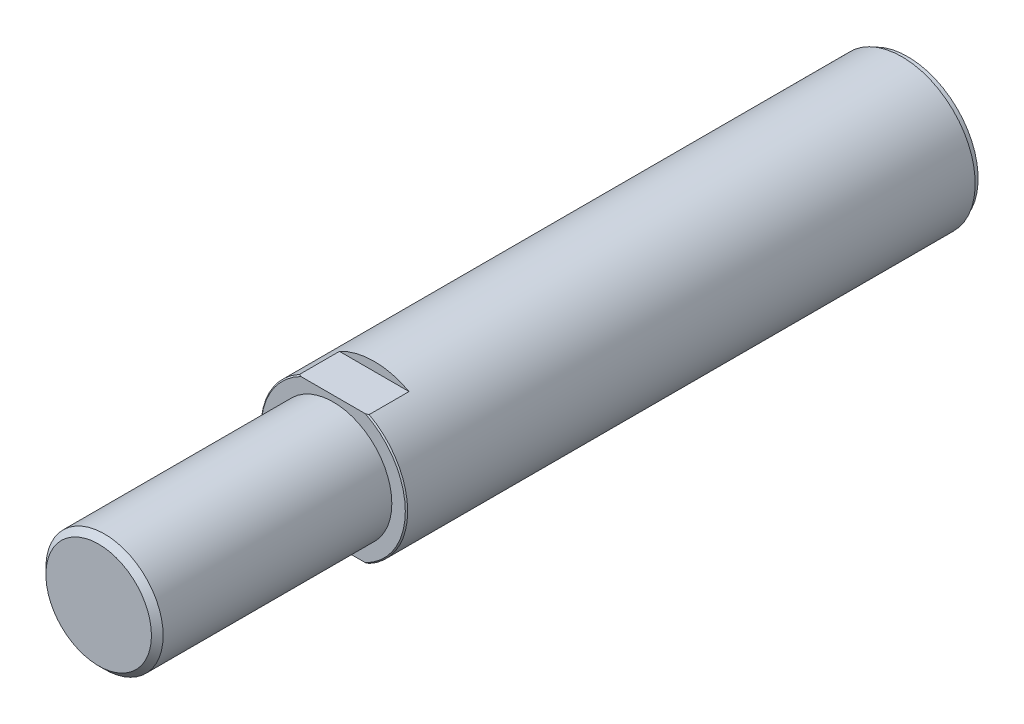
ISO-10303-21;
HEADER;
FILE_DESCRIPTION(('STEP AP214'),'2;1');
FILE_NAME('part.step','',(''),(''),'','','');
FILE_SCHEMA(('AUTOMOTIVE_DESIGN { 1 0 10303 214 1 1 1 1 }'));
ENDSEC;
DATA;
#1=APPLICATION_CONTEXT('core data for automotive mechanical design processes');
#2=APPLICATION_PROTOCOL_DEFINITION('international standard','automotive_design',2000,#1);
#3=PRODUCT_CONTEXT('',#1,'mechanical');
#4=PRODUCT('Part','Part','',(#3));
#5=PRODUCT_RELATED_PRODUCT_CATEGORY('part','',(#4));
#6=PRODUCT_DEFINITION_FORMATION('','',#4);
#7=PRODUCT_DEFINITION_CONTEXT('part definition',#1,'design');
#8=PRODUCT_DEFINITION('design','',#6,#7);
#9=PRODUCT_DEFINITION_SHAPE('','',#8);
#10=(LENGTH_UNIT() NAMED_UNIT(*) SI_UNIT(.MILLI.,.METRE.));
#11=(NAMED_UNIT(*) PLANE_ANGLE_UNIT() SI_UNIT($,.RADIAN.));
#12=(NAMED_UNIT(*) SI_UNIT($,.STERADIAN.) SOLID_ANGLE_UNIT());
#13=UNCERTAINTY_MEASURE_WITH_UNIT(LENGTH_MEASURE(1.E-05),#10,'distance_accuracy_value','');
#14=(GEOMETRIC_REPRESENTATION_CONTEXT(3) GLOBAL_UNCERTAINTY_ASSIGNED_CONTEXT((#13)) GLOBAL_UNIT_ASSIGNED_CONTEXT((#10,
#11,#12)) REPRESENTATION_CONTEXT('',''));
#15=CARTESIAN_POINT('',(0.,0.,0.));
#16=DIRECTION('',(0.,0.,1.));
#17=DIRECTION('',(1.,0.,0.));
#18=AXIS2_PLACEMENT_3D('',#15,#16,#17);
#19=CARTESIAN_POINT('',(0.,0.,138.));
#20=DIRECTION('',(0.,0.,-1.));
#21=DIRECTION('',(-1.,0.,0.));
#22=AXIS2_PLACEMENT_3D('',#19,#20,#21);
#23=CYLINDRICAL_SURFACE('',#22,12.5);
#24=CARTESIAN_POINT('',(0.,0.,1.));
#25=DIRECTION('',(0.,0.,-1.));
#26=DIRECTION('',(-1.,0.,0.));
#27=AXIS2_PLACEMENT_3D('',#24,#25,#26);
#28=CIRCLE('',#27,12.5);
#29=CARTESIAN_POINT('',(-12.5,0.,1.));
#30=VERTEX_POINT('',#29);
#31=EDGE_CURVE('E128',#30,#30,#28,.T.);
#32=ORIENTED_EDGE('',*,*,#31,.F.);
#33=EDGE_LOOP('',(#32));
#34=FACE_BOUND('',#33,.T.);
#35=DIRECTION('',(0.,0.,-1.));
#36=VECTOR('',#35,1.);
#37=CARTESIAN_POINT('',(-5.93717104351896,-11.,138.));
#38=LINE('',#37,#36);
#39=CARTESIAN_POINT('',(-5.93717104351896,-11.,97.8));
#40=VERTEX_POINT('',#39);
#41=CARTESIAN_POINT('',(-5.93717104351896,-11.,91.));
#42=VERTEX_POINT('',#41);
#43=EDGE_CURVE('E199',#40,#42,#38,.T.);
#44=ORIENTED_EDGE('',*,*,#43,.F.);
#45=CARTESIAN_POINT('',(0.,0.,97.8));
#46=DIRECTION('',(0.,0.,1.));
#47=DIRECTION('',(1.,0.,0.));
#48=AXIS2_PLACEMENT_3D('',#45,#46,#47);
#49=CIRCLE('',#48,12.5);
#50=CARTESIAN_POINT('',(-5.93717104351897,11.,97.8));
#51=VERTEX_POINT('',#50);
#52=EDGE_CURVE('E130',#40,#51,#49,.F.);
#53=ORIENTED_EDGE('',*,*,#52,.T.);
#54=DIRECTION('',(0.,0.,-1.));
#55=VECTOR('',#54,1.);
#56=CARTESIAN_POINT('',(-5.93717104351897,11.,138.));
#57=LINE('',#56,#55);
#58=CARTESIAN_POINT('',(-5.93717104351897,11.,91.));
#59=VERTEX_POINT('',#58);
#60=EDGE_CURVE('E57',#59,#51,#57,.F.);
#61=ORIENTED_EDGE('',*,*,#60,.F.);
#62=CARTESIAN_POINT('',(0.,0.,91.));
#63=DIRECTION('',(0.,0.,1.));
#64=DIRECTION('',(1.,0.,0.));
#65=AXIS2_PLACEMENT_3D('',#62,#63,#64);
#66=CIRCLE('',#65,12.5);
#67=CARTESIAN_POINT('',(5.93717104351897,11.,91.));
#68=VERTEX_POINT('',#67);
#69=EDGE_CURVE('E46',#68,#59,#66,.T.);
#70=ORIENTED_EDGE('',*,*,#69,.F.);
#71=DIRECTION('',(0.,0.,-1.));
#72=VECTOR('',#71,1.);
#73=CARTESIAN_POINT('',(5.93717104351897,11.,138.));
#74=LINE('',#73,#72);
#75=CARTESIAN_POINT('',(5.93717104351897,11.,97.8));
#76=VERTEX_POINT('',#75);
#77=EDGE_CURVE('E208',#76,#68,#74,.T.);
#78=ORIENTED_EDGE('',*,*,#77,.F.);
#79=CARTESIAN_POINT('',(5.93717104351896,-11.,97.8));
#80=VERTEX_POINT('',#79);
#81=EDGE_CURVE('E115',#76,#80,#49,.F.);
#82=ORIENTED_EDGE('',*,*,#81,.T.);
#83=DIRECTION('',(0.,0.,-1.));
#84=VECTOR('',#83,1.);
#85=CARTESIAN_POINT('',(5.93717104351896,-11.,138.));
#86=LINE('',#85,#84);
#87=CARTESIAN_POINT('',(5.93717104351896,-11.,91.));
#88=VERTEX_POINT('',#87);
#89=EDGE_CURVE('E65',#88,#80,#86,.F.);
#90=ORIENTED_EDGE('',*,*,#89,.F.);
#91=EDGE_CURVE('E12',#42,#88,#66,.T.);
#92=ORIENTED_EDGE('',*,*,#91,.F.);
#93=EDGE_LOOP('',(#44,#53,#61,#70,#78,#82,#90,#92));
#94=FACE_BOUND('',#93,.T.);
#95=ADVANCED_FACE('F42',(#34,#94),#23,.T.);
#96=CARTESIAN_POINT('',(0.,0.,98.));
#97=DIRECTION('',(0.,0.,1.));
#98=DIRECTION('',(1.,0.,0.));
#99=AXIS2_PLACEMENT_3D('',#96,#97,#98);
#100=PLANE('',#99);
#101=CARTESIAN_POINT('',(0.,0.,98.));
#102=DIRECTION('',(0.,0.,1.));
#103=DIRECTION('',(1.,0.,0.));
#104=AXIS2_PLACEMENT_3D('',#101,#102,#103);
#105=CIRCLE('',#104,10.);
#106=CARTESIAN_POINT('',(10.,0.,98.));
#107=VERTEX_POINT('',#106);
#108=EDGE_CURVE('E121',#107,#107,#105,.T.);
#109=ORIENTED_EDGE('',*,*,#108,.F.);
#110=EDGE_LOOP('',(#109));
#111=FACE_BOUND('',#110,.T.);
#112=CARTESIAN_POINT('',(0.,0.,98.));
#113=DIRECTION('',(0.,0.,1.));
#114=DIRECTION('',(1.,0.,0.));
#115=AXIS2_PLACEMENT_3D('',#112,#113,#114);
#116=CIRCLE('',#115,12.3);
#117=CARTESIAN_POINT('',(-5.50363516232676,11.,98.));
#118=VERTEX_POINT('',#117);
#119=CARTESIAN_POINT('',(-5.50363516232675,-11.,98.));
#120=VERTEX_POINT('',#119);
#121=EDGE_CURVE('E120',#118,#120,#116,.T.);
#122=ORIENTED_EDGE('',*,*,#121,.T.);
#123=DIRECTION('',(1.,0.,0.));
#124=VECTOR('',#123,1.);
#125=CARTESIAN_POINT('',(-21.0914396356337,-11.,98.));
#126=LINE('',#125,#124);
#127=CARTESIAN_POINT('',(5.50363516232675,-11.,98.));
#128=VERTEX_POINT('',#127);
#129=EDGE_CURVE('E107',#120,#128,#126,.T.);
#130=ORIENTED_EDGE('',*,*,#129,.T.);
#131=CARTESIAN_POINT('',(5.50363516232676,11.,98.));
#132=VERTEX_POINT('',#131);
#133=EDGE_CURVE('E113',#128,#132,#116,.T.);
#134=ORIENTED_EDGE('',*,*,#133,.T.);
#135=DIRECTION('',(-1.,0.,0.));
#136=VECTOR('',#135,1.);
#137=CARTESIAN_POINT('',(-21.0914396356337,11.,98.));
#138=LINE('',#137,#136);
#139=EDGE_CURVE('E97',#132,#118,#138,.T.);
#140=ORIENTED_EDGE('',*,*,#139,.T.);
#141=EDGE_LOOP('',(#122,#130,#134,#140));
#142=FACE_BOUND('',#141,.T.);
#143=ADVANCED_FACE('F119',(#111,#142),#100,.T.);
#144=CARTESIAN_POINT('',(0.,0.,98.));
#145=DIRECTION('',(0.,0.,-1.));
#146=DIRECTION('',(-1.,0.,0.));
#147=AXIS2_PLACEMENT_3D('',#144,#145,#146);
#148=CONICAL_SURFACE('',#147,12.3,0.785398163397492);
#149=ORIENTED_EDGE('',*,*,#52,.F.);
#150=CARTESIAN_POINT('',(-25.2049082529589,-11.,82.7993200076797));
#151=CARTESIAN_POINT('',(-24.8332961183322,-11.,83.1398994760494));
#152=CARTESIAN_POINT('',(-24.4610927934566,-11.,83.4798355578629));
#153=CARTESIAN_POINT('',(-23.7153278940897,-11.,84.1582204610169));
#154=CARTESIAN_POINT('',(-23.3417663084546,-11.,84.4966692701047));
#155=CARTESIAN_POINT('',(-22.5930262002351,-11.,85.1719537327));
#156=CARTESIAN_POINT('',(-22.2178473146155,-11.,85.508788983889));
#157=CARTESIAN_POINT('',(-21.4657494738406,-11.,86.1805104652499));
#158=CARTESIAN_POINT('',(-21.0888305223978,-11.,86.5153966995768));
#159=CARTESIAN_POINT('',(-20.3305063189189,-11.,87.1851207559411));
#160=CARTESIAN_POINT('',(-19.9490878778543,-11.,87.5199436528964));
#161=CARTESIAN_POINT('',(-19.1839299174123,-11.,88.186926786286));
#162=CARTESIAN_POINT('',(-18.8001904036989,-11.,88.5190870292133));
#163=CARTESIAN_POINT('',(-18.0300668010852,-11.,89.180238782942));
#164=CARTESIAN_POINT('',(-17.6436830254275,-11.,89.5092306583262));
#165=CARTESIAN_POINT('',(-16.8677829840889,-11.,90.1635010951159));
#166=CARTESIAN_POINT('',(-16.4782667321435,-11.,90.4887796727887));
#167=CARTESIAN_POINT('',(-15.7614675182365,-11.,91.0804751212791));
#168=CARTESIAN_POINT('',(-15.4347519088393,-11.,91.3475789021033));
#169=CARTESIAN_POINT('',(-14.7783997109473,-11.,91.8781715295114));
#170=CARTESIAN_POINT('',(-14.4487631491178,-11.,92.1416604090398));
#171=CARTESIAN_POINT('',(-13.7860202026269,-11.,92.664443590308));
#172=CARTESIAN_POINT('',(-13.4529128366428,-11.,92.9237366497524));
#173=CARTESIAN_POINT('',(-12.7827870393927,-11.,93.4372220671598));
#174=CARTESIAN_POINT('',(-12.4457686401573,-11.,93.6914144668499));
#175=CARTESIAN_POINT('',(-11.7675925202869,-11.,94.1933465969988));
#176=CARTESIAN_POINT('',(-11.4264404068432,-11.,94.4410938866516));
#177=CARTESIAN_POINT('',(-10.7388110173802,-11.,94.9291387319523));
#178=CARTESIAN_POINT('',(-10.3923335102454,-11.,95.1694359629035));
#179=CARTESIAN_POINT('',(-9.69333013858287,-11.,95.6407355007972));
#180=CARTESIAN_POINT('',(-9.34080722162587,-11.,95.8717421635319));
#181=CARTESIAN_POINT('',(-8.628549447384,-11.,96.3223116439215));
#182=CARTESIAN_POINT('',(-8.26881550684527,-11.,96.5418759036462));
#183=CARTESIAN_POINT('',(-7.54622405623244,-11.,96.9635589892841));
#184=CARTESIAN_POINT('',(-7.18348838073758,-11.,97.1658853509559));
#185=CARTESIAN_POINT('',(-6.44862768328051,-11.,97.5529518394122));
#186=CARTESIAN_POINT('',(-6.07650171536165,-11.,97.737690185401));
#187=CARTESIAN_POINT('',(-5.32234700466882,-11.,98.0846232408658));
#188=CARTESIAN_POINT('',(-4.94033118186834,-11.,98.2468457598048));
#189=CARTESIAN_POINT('',(-4.16548005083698,-11.,98.5431605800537));
#190=CARTESIAN_POINT('',(-3.77264786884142,-11.,98.6772609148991));
#191=CARTESIAN_POINT('',(-3.05749092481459,-11.,98.8870100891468));
#192=CARTESIAN_POINT('',(-2.73703620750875,-11.,98.968998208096));
#193=CARTESIAN_POINT('',(-2.0906367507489,-11.,99.1075378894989));
#194=CARTESIAN_POINT('',(-1.76469277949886,-11.,99.1640929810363));
#195=CARTESIAN_POINT('',(-1.10994339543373,-11.,99.2488943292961));
#196=CARTESIAN_POINT('',(-0.781147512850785,-11.,99.2772131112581));
#197=CARTESIAN_POINT('',(-0.122326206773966,-11.,99.3042432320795));
#198=CARTESIAN_POINT('',(0.207699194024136,-11.,99.3029551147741));
#199=CARTESIAN_POINT('',(0.866187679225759,-11.,99.270850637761));
#200=CARTESIAN_POINT('',(1.19465120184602,-11.,99.240043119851));
#201=CARTESIAN_POINT('',(1.84773423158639,-11.,99.1505870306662));
#202=CARTESIAN_POINT('',(2.17235340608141,-11.,99.0919360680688));
#203=CARTESIAN_POINT('',(2.81692746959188,-11.,98.9494087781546));
#204=CARTESIAN_POINT('',(3.13686596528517,-11.,98.865459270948));
#205=CARTESIAN_POINT('',(3.77013120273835,-11.,98.6757764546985));
#206=CARTESIAN_POINT('',(4.08345803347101,-11.,98.5700434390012));
#207=CARTESIAN_POINT('',(4.77959899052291,-11.,98.3118471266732));
#208=CARTESIAN_POINT('',(5.16051287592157,-11.,98.1542887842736));
#209=CARTESIAN_POINT('',(5.91217216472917,-11.,97.8163719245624));
#210=CARTESIAN_POINT('',(6.28291247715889,-11.,97.636002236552));
#211=CARTESIAN_POINT('',(7.01572159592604,-11.,97.2569234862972));
#212=CARTESIAN_POINT('',(7.3777724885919,-11.,97.0581800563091));
#213=CARTESIAN_POINT('',(8.09354374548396,-11.,96.6464369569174));
#214=CARTESIAN_POINT('',(8.44726541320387,-11.,96.4334395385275));
#215=CARTESIAN_POINT('',(9.15130038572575,-11.,95.9937098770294));
#216=CARTESIAN_POINT('',(9.50153682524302,-11.,95.7668551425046));
#217=CARTESIAN_POINT('',(10.1957742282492,-11.,95.3037685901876));
#218=CARTESIAN_POINT('',(10.5397746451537,-11.,95.0675359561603));
#219=CARTESIAN_POINT('',(11.2225281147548,-11.,94.5873865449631));
#220=CARTESIAN_POINT('',(11.5612793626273,-11.,94.343467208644));
#221=CARTESIAN_POINT('',(12.2341678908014,-11.,93.8493837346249));
#222=CARTESIAN_POINT('',(12.5683053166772,-11.,93.5992197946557));
#223=CARTESIAN_POINT('',(13.4491244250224,-11.,92.928993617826));
#224=CARTESIAN_POINT('',(13.9924028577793,-11.,92.5044606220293));
#225=CARTESIAN_POINT('',(15.0704026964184,-11.,91.644933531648));
#226=CARTESIAN_POINT('',(15.6051257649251,-11.,91.209941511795));
#227=CARTESIAN_POINT('',(16.6682135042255,-11.,90.3315328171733));
#228=CARTESIAN_POINT('',(17.1965735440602,-11.,89.888110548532));
#229=CARTESIAN_POINT('',(18.2478896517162,-11.,88.9948668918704));
#230=CARTESIAN_POINT('',(18.7708454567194,-11.,88.5450451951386));
#231=CARTESIAN_POINT('',(19.791175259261,-11.,87.658678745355));
#232=CARTESIAN_POINT('',(20.2887256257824,-11.,87.2223367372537));
#233=CARTESIAN_POINT('',(21.2804238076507,-11.,86.3458210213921));
#234=CARTESIAN_POINT('',(21.7745716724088,-11.,85.9056473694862));
#235=CARTESIAN_POINT('',(22.7594616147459,-11.,85.0226290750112));
#236=CARTESIAN_POINT('',(23.2502069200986,-11.,84.5797880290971));
#237=CARTESIAN_POINT('',(24.2292721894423,-11.,83.6914346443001));
#238=CARTESIAN_POINT('',(24.7175921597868,-11.,83.2459223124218));
#239=CARTESIAN_POINT('',(25.2049082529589,-11.,82.7993200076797));
#240=B_SPLINE_CURVE_WITH_KNOTS('',3,(#150,#151,#152,#153,#154,#155,#156,#157,#158,#159,#160,
#161,#162,#163,#164,#165,#166,#167,#168,#169,#170,#171,#172,#173,#174,#175,#176,#177,#178,#179,
#180,#181,#182,#183,#184,#185,#186,#187,#188,#189,#190,#191,#192,#193,#194,#195,#196,#197,#198,
#199,#200,#201,#202,#203,#204,#205,#206,#207,#208,#209,#210,#211,#212,#213,#214,#215,#216,#217,
#218,#219,#220,#221,#222,#223,#224,#225,#226,#227,#228,#229,#230,#231,#232,#233,#234,#235,#236,
#237,#238,#239),.UNSPECIFIED.,.F.,.F.,(4,2,2,2,2,2,2,2,2,2,2,2,2,2,2,2,2,2,2,2,2,2,2,2,2,2,2,2,
2,2,2,2,2,2,2,2,2,2,2,2,2,2,2,2,4),(0.,1.51222100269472,3.02445444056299,4.53704712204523,
6.04963657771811,7.57221518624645,9.09479008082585,10.6171876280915,12.1395785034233,
13.4055696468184,14.6715492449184,15.9378970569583,17.2042345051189,18.4690128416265,
19.733846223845,20.9980795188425,22.262153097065,23.5078130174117,24.7535989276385,
25.9978321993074,27.2417095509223,28.2331520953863,29.2244570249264,30.2132091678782,
31.2019431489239,32.1903810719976,33.1789039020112,34.1703140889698,35.1617109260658,
36.3973752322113,37.6336470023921,38.8722798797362,40.1107176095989,41.3623951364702,
42.6141818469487,43.8663898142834,45.1185581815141,47.1867976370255,49.2546301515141,
51.3238862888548,53.3932425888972,55.3785544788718,57.3638374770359,59.346868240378,
61.3298938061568),.UNSPECIFIED.);
#241=EDGE_CURVE('E206',#40,#120,#240,.T.);
#242=ORIENTED_EDGE('',*,*,#241,.T.);
#243=ORIENTED_EDGE('',*,*,#121,.F.);
#244=CARTESIAN_POINT('',(25.2049082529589,11.,82.7993200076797));
#245=CARTESIAN_POINT('',(24.8332961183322,11.,83.1398994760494));
#246=CARTESIAN_POINT('',(24.4610927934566,11.,83.4798355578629));
#247=CARTESIAN_POINT('',(23.7153278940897,11.,84.1582204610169));
#248=CARTESIAN_POINT('',(23.3417663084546,11.,84.4966692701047));
#249=CARTESIAN_POINT('',(22.5930262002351,11.,85.1719537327));
#250=CARTESIAN_POINT('',(22.2178473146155,11.,85.508788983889));
#251=CARTESIAN_POINT('',(21.4657494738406,11.,86.1805104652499));
#252=CARTESIAN_POINT('',(21.0888305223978,11.,86.5153966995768));
#253=CARTESIAN_POINT('',(20.3305063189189,11.,87.1851207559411));
#254=CARTESIAN_POINT('',(19.9490878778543,11.,87.5199436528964));
#255=CARTESIAN_POINT('',(19.1839299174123,11.,88.186926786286));
#256=CARTESIAN_POINT('',(18.8001904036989,11.,88.5190870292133));
#257=CARTESIAN_POINT('',(18.0300668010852,11.,89.180238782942));
#258=CARTESIAN_POINT('',(17.6436830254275,11.,89.5092306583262));
#259=CARTESIAN_POINT('',(16.8677829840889,11.,90.1635010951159));
#260=CARTESIAN_POINT('',(16.4782667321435,11.,90.4887796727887));
#261=CARTESIAN_POINT('',(15.7614675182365,11.,91.0804751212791));
#262=CARTESIAN_POINT('',(15.4347519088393,11.,91.3475789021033));
#263=CARTESIAN_POINT('',(14.7783997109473,11.,91.8781715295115));
#264=CARTESIAN_POINT('',(14.4487631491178,11.,92.1416604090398));
#265=CARTESIAN_POINT('',(13.7860202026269,11.,92.664443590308));
#266=CARTESIAN_POINT('',(13.4529128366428,11.,92.9237366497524));
#267=CARTESIAN_POINT('',(12.7827870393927,11.,93.4372220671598));
#268=CARTESIAN_POINT('',(12.4457686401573,11.,93.6914144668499));
#269=CARTESIAN_POINT('',(11.7675925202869,11.,94.1933465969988));
#270=CARTESIAN_POINT('',(11.4264404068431,11.,94.4410938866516));
#271=CARTESIAN_POINT('',(10.7388110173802,11.,94.9291387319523));
#272=CARTESIAN_POINT('',(10.3923335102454,11.,95.1694359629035));
#273=CARTESIAN_POINT('',(9.69333013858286,11.,95.6407355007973));
#274=CARTESIAN_POINT('',(9.34080722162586,11.,95.8717421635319));
#275=CARTESIAN_POINT('',(8.628549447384,11.,96.3223116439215));
#276=CARTESIAN_POINT('',(8.26881550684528,11.,96.5418759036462));
#277=CARTESIAN_POINT('',(7.54622405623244,11.,96.9635589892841));
#278=CARTESIAN_POINT('',(7.18348838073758,11.,97.1658853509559));
#279=CARTESIAN_POINT('',(6.4486276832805,11.,97.5529518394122));
#280=CARTESIAN_POINT('',(6.07650171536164,11.,97.737690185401));
#281=CARTESIAN_POINT('',(5.32234700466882,11.,98.0846232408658));
#282=CARTESIAN_POINT('',(4.94033118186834,11.,98.2468457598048));
#283=CARTESIAN_POINT('',(4.16548005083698,11.,98.5431605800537));
#284=CARTESIAN_POINT('',(3.77264786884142,11.,98.6772609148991));
#285=CARTESIAN_POINT('',(3.05749092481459,11.,98.8870100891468));
#286=CARTESIAN_POINT('',(2.73703620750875,11.,98.968998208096));
#287=CARTESIAN_POINT('',(2.0906367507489,11.,99.1075378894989));
#288=CARTESIAN_POINT('',(1.76469277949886,11.,99.1640929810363));
#289=CARTESIAN_POINT('',(1.10994339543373,11.,99.2488943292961));
#290=CARTESIAN_POINT('',(0.781147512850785,11.,99.2772131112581));
#291=CARTESIAN_POINT('',(0.122326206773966,11.,99.3042432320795));
#292=CARTESIAN_POINT('',(-0.207699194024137,11.,99.3029551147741));
#293=CARTESIAN_POINT('',(-0.866187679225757,11.,99.270850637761));
#294=CARTESIAN_POINT('',(-1.19465120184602,11.,99.240043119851));
#295=CARTESIAN_POINT('',(-1.84773423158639,11.,99.1505870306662));
#296=CARTESIAN_POINT('',(-2.17235340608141,11.,99.0919360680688));
#297=CARTESIAN_POINT('',(-2.81692746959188,11.,98.9494087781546));
#298=CARTESIAN_POINT('',(-3.13686596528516,11.,98.865459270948));
#299=CARTESIAN_POINT('',(-3.77013120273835,11.,98.6757764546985));
#300=CARTESIAN_POINT('',(-4.08345803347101,11.,98.5700434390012));
#301=CARTESIAN_POINT('',(-4.77959899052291,11.,98.3118471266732));
#302=CARTESIAN_POINT('',(-5.16051287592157,11.,98.1542887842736));
#303=CARTESIAN_POINT('',(-5.91217216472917,11.,97.8163719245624));
#304=CARTESIAN_POINT('',(-6.2829124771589,11.,97.636002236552));
#305=CARTESIAN_POINT('',(-7.01572159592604,11.,97.2569234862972));
#306=CARTESIAN_POINT('',(-7.3777724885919,11.,97.0581800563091));
#307=CARTESIAN_POINT('',(-8.09354374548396,11.,96.6464369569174));
#308=CARTESIAN_POINT('',(-8.44726541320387,11.,96.4334395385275));
#309=CARTESIAN_POINT('',(-9.15130038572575,11.,95.9937098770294));
#310=CARTESIAN_POINT('',(-9.50153682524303,11.,95.7668551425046));
#311=CARTESIAN_POINT('',(-10.1957742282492,11.,95.3037685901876));
#312=CARTESIAN_POINT('',(-10.5397746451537,11.,95.0675359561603));
#313=CARTESIAN_POINT('',(-11.2225281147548,11.,94.5873865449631));
#314=CARTESIAN_POINT('',(-11.5612793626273,11.,94.343467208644));
#315=CARTESIAN_POINT('',(-12.2341678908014,11.,93.8493837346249));
#316=CARTESIAN_POINT('',(-12.5683053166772,11.,93.5992197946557));
#317=CARTESIAN_POINT('',(-13.4491244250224,11.,92.928993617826));
#318=CARTESIAN_POINT('',(-13.9924028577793,11.,92.5044606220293));
#319=CARTESIAN_POINT('',(-15.0704026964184,11.,91.644933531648));
#320=CARTESIAN_POINT('',(-15.6051257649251,11.,91.209941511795));
#321=CARTESIAN_POINT('',(-16.6682135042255,11.,90.3315328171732));
#322=CARTESIAN_POINT('',(-17.1965735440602,11.,89.8881105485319));
#323=CARTESIAN_POINT('',(-18.2478896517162,11.,88.9948668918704));
#324=CARTESIAN_POINT('',(-18.7708454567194,11.,88.5450451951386));
#325=CARTESIAN_POINT('',(-19.791175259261,11.,87.658678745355));
#326=CARTESIAN_POINT('',(-20.2887256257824,11.,87.2223367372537));
#327=CARTESIAN_POINT('',(-21.2804238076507,11.,86.3458210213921));
#328=CARTESIAN_POINT('',(-21.7745716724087,11.,85.9056473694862));
#329=CARTESIAN_POINT('',(-22.7594616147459,11.,85.0226290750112));
#330=CARTESIAN_POINT('',(-23.2502069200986,11.,84.5797880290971));
#331=CARTESIAN_POINT('',(-24.2292721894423,11.,83.6914346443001));
#332=CARTESIAN_POINT('',(-24.7175921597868,11.,83.2459223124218));
#333=CARTESIAN_POINT('',(-25.2049082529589,11.,82.7993200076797));
#334=B_SPLINE_CURVE_WITH_KNOTS('',3,(#244,#245,#246,#247,#248,#249,#250,#251,#252,#253,#254,
#255,#256,#257,#258,#259,#260,#261,#262,#263,#264,#265,#266,#267,#268,#269,#270,#271,#272,#273,
#274,#275,#276,#277,#278,#279,#280,#281,#282,#283,#284,#285,#286,#287,#288,#289,#290,#291,#292,
#293,#294,#295,#296,#297,#298,#299,#300,#301,#302,#303,#304,#305,#306,#307,#308,#309,#310,#311,
#312,#313,#314,#315,#316,#317,#318,#319,#320,#321,#322,#323,#324,#325,#326,#327,#328,#329,#330,
#331,#332,#333),.UNSPECIFIED.,.F.,.F.,(4,2,2,2,2,2,2,2,2,2,2,2,2,2,2,2,2,2,2,2,2,2,2,2,2,2,2,2,
2,2,2,2,2,2,2,2,2,2,2,2,2,2,2,2,4),(0.,1.51222100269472,3.024454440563,4.53704712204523,
6.04963657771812,7.57221518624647,9.09479008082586,10.6171876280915,12.1395785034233,
13.4055696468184,14.6715492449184,15.9378970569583,17.2042345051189,18.4690128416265,
19.733846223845,20.9980795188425,22.262153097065,23.5078130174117,24.7535989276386,
25.9978321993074,27.2417095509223,28.2331520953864,29.2244570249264,30.2132091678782,
31.2019431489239,32.1903810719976,33.1789039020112,34.1703140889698,35.1617109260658,
36.3973752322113,37.6336470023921,38.8722798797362,40.1107176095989,41.3623951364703,
42.6141818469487,43.8663898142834,45.1185581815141,47.1867976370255,49.2546301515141,
51.3238862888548,53.3932425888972,55.3785544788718,57.3638374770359,59.346868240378,
61.3298938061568),.UNSPECIFIED.);
#335=EDGE_CURVE('E102',#118,#51,#334,.T.);
#336=ORIENTED_EDGE('',*,*,#335,.T.);
#337=EDGE_LOOP('',(#149,#242,#243,#336));
#338=FACE_BOUND('',#337,.T.);
#339=ADVANCED_FACE('F146',(#338),#148,.T.);
#340=ORIENTED_EDGE('',*,*,#133,.F.);
#341=EDGE_CURVE('E116',#128,#80,#240,.T.);
#342=ORIENTED_EDGE('',*,*,#341,.T.);
#343=ORIENTED_EDGE('',*,*,#81,.F.);
#344=EDGE_CURVE('E100',#76,#132,#334,.T.);
#345=ORIENTED_EDGE('',*,*,#344,.T.);
#346=EDGE_LOOP('',(#340,#342,#343,#345));
#347=FACE_BOUND('',#346,.T.);
#348=ADVANCED_FACE('F112',(#347),#148,.T.);
#349=CARTESIAN_POINT('',(0.,0.,98.));
#350=DIRECTION('',(0.,0.,1.));
#351=DIRECTION('',(1.,0.,0.));
#352=AXIS2_PLACEMENT_3D('',#349,#350,#351);
#353=CYLINDRICAL_SURFACE('',#352,10.);
#354=CARTESIAN_POINT('',(0.,0.,137.));
#355=DIRECTION('',(0.,0.,1.));
#356=DIRECTION('',(1.,0.,0.));
#357=AXIS2_PLACEMENT_3D('',#354,#355,#356);
#358=CIRCLE('',#357,10.);
#359=CARTESIAN_POINT('',(10.,0.,137.));
#360=VERTEX_POINT('',#359);
#361=EDGE_CURVE('E134',#360,#360,#358,.F.);
#362=ORIENTED_EDGE('',*,*,#361,.T.);
#363=EDGE_LOOP('',(#362));
#364=FACE_BOUND('',#363,.T.);
#365=ORIENTED_EDGE('',*,*,#108,.T.);
#366=EDGE_LOOP('',(#365));
#367=FACE_BOUND('',#366,.T.);
#368=ADVANCED_FACE('F177',(#364,#367),#353,.T.);
#369=CARTESIAN_POINT('',(0.,0.,138.));
#370=DIRECTION('',(0.,0.,1.));
#371=DIRECTION('',(1.,0.,0.));
#372=AXIS2_PLACEMENT_3D('',#369,#370,#371);
#373=PLANE('',#372);
#374=CARTESIAN_POINT('',(0.,0.,138.));
#375=DIRECTION('',(0.,0.,1.));
#376=DIRECTION('',(1.,0.,0.));
#377=AXIS2_PLACEMENT_3D('',#374,#375,#376);
#378=CIRCLE('',#377,9.00000000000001);
#379=CARTESIAN_POINT('',(9.00000000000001,0.,138.));
#380=VERTEX_POINT('',#379);
#381=EDGE_CURVE('E131',#380,#380,#378,.T.);
#382=ORIENTED_EDGE('',*,*,#381,.T.);
#383=EDGE_LOOP('',(#382));
#384=FACE_BOUND('',#383,.T.);
#385=ADVANCED_FACE('F167',(#384),#373,.T.);
#386=CARTESIAN_POINT('',(0.,0.,1.));
#387=DIRECTION('',(0.,0.,-1.));
#388=DIRECTION('',(-1.,0.,0.));
#389=AXIS2_PLACEMENT_3D('',#386,#387,#388);
#390=PLANE('',#389);
#391=CARTESIAN_POINT('',(0.,0.,1.));
#392=DIRECTION('',(0.,0.,-1.));
#393=DIRECTION('',(-1.,0.,0.));
#394=AXIS2_PLACEMENT_3D('',#391,#392,#393);
#395=CIRCLE('',#394,12.);
#396=CARTESIAN_POINT('',(-12.,0.,1.));
#397=VERTEX_POINT('',#396);
#398=EDGE_CURVE('E216',#397,#397,#395,.T.);
#399=ORIENTED_EDGE('',*,*,#398,.F.);
#400=EDGE_LOOP('',(#399));
#401=FACE_BOUND('',#400,.T.);
#402=ORIENTED_EDGE('',*,*,#31,.T.);
#403=EDGE_LOOP('',(#402));
#404=FACE_BOUND('',#403,.T.);
#405=ADVANCED_FACE('F163',(#401,#404),#390,.T.);
#406=CARTESIAN_POINT('',(0.,0.,1.));
#407=DIRECTION('',(0.,0.,-1.));
#408=DIRECTION('',(-1.,0.,0.));
#409=AXIS2_PLACEMENT_3D('',#406,#407,#408);
#410=CYLINDRICAL_SURFACE('',#409,12.);
#411=ORIENTED_EDGE('',*,*,#398,.T.);
#412=EDGE_LOOP('',(#411));
#413=FACE_BOUND('',#412,.T.);
#414=CARTESIAN_POINT('',(0.,0.,0.));
#415=DIRECTION('',(0.,0.,-1.));
#416=DIRECTION('',(-1.,0.,0.));
#417=AXIS2_PLACEMENT_3D('',#414,#415,#416);
#418=CIRCLE('',#417,12.);
#419=CARTESIAN_POINT('',(-12.,0.,0.));
#420=VERTEX_POINT('',#419);
#421=EDGE_CURVE('E202',#420,#420,#418,.T.);
#422=ORIENTED_EDGE('',*,*,#421,.F.);
#423=EDGE_LOOP('',(#422));
#424=FACE_BOUND('',#423,.T.);
#425=ADVANCED_FACE('F159',(#413,#424),#410,.T.);
#426=CARTESIAN_POINT('',(0.,0.,32.75));
#427=DIRECTION('',(0.,0.,-1.));
#428=DIRECTION('',(-1.,0.,0.));
#429=AXIS2_PLACEMENT_3D('',#426,#427,#428);
#430=CONICAL_SURFACE('',#429,5.09999999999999,1.02974425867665);
#431=CARTESIAN_POINT('',(0.,0.,35.8143891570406));
#432=VERTEX_POINT('',#431);
#433=VERTEX_LOOP('',#432);
#434=FACE_BOUND('',#433,.T.);
#435=CARTESIAN_POINT('',(0.,0.,32.75));
#436=DIRECTION('',(0.,0.,-1.));
#437=DIRECTION('',(-1.,0.,0.));
#438=AXIS2_PLACEMENT_3D('',#435,#436,#437);
#439=CIRCLE('',#438,5.09999999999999);
#440=CARTESIAN_POINT('',(-5.09999999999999,0.,32.75));
#441=VERTEX_POINT('',#440);
#442=EDGE_CURVE('E124',#441,#441,#439,.T.);
#443=ORIENTED_EDGE('',*,*,#442,.T.);
#444=EDGE_LOOP('',(#443));
#445=FACE_BOUND('',#444,.T.);
#446=ADVANCED_FACE('F162',(#434,#445),#430,.F.);
#447=CARTESIAN_POINT('',(0.,0.,0.));
#448=DIRECTION('',(0.,0.,-1.));
#449=DIRECTION('',(-1.,0.,0.));
#450=AXIS2_PLACEMENT_3D('',#447,#448,#449);
#451=CYLINDRICAL_SURFACE('',#450,5.09999999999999);
#452=ORIENTED_EDGE('',*,*,#442,.F.);
#453=EDGE_LOOP('',(#452));
#454=FACE_BOUND('',#453,.T.);
#455=CARTESIAN_POINT('',(0.,0.,0.));
#456=DIRECTION('',(0.,0.,-1.));
#457=DIRECTION('',(-1.,0.,0.));
#458=AXIS2_PLACEMENT_3D('',#455,#456,#457);
#459=CIRCLE('',#458,5.1);
#460=CARTESIAN_POINT('',(-5.1,0.,0.));
#461=VERTEX_POINT('',#460);
#462=EDGE_CURVE('E221',#461,#461,#459,.T.);
#463=ORIENTED_EDGE('',*,*,#462,.T.);
#464=EDGE_LOOP('',(#463));
#465=FACE_BOUND('',#464,.T.);
#466=ADVANCED_FACE('F169',(#454,#465),#451,.F.);
#467=CARTESIAN_POINT('',(0.,0.,0.));
#468=DIRECTION('',(0.,0.,1.));
#469=DIRECTION('',(1.,0.,0.));
#470=AXIS2_PLACEMENT_3D('',#467,#468,#469);
#471=PLANE('',#470);
#472=ORIENTED_EDGE('',*,*,#462,.F.);
#473=EDGE_LOOP('',(#472));
#474=FACE_BOUND('',#473,.T.);
#475=ORIENTED_EDGE('',*,*,#421,.T.);
#476=EDGE_LOOP('',(#475));
#477=FACE_BOUND('',#476,.T.);
#478=ADVANCED_FACE('F172',(#474,#477),#471,.F.);
#479=CARTESIAN_POINT('',(0.,0.,138.));
#480=DIRECTION('',(0.,0.,-1.));
#481=DIRECTION('',(-1.,0.,0.));
#482=AXIS2_PLACEMENT_3D('',#479,#480,#481);
#483=CONICAL_SURFACE('',#482,9.00000000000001,0.785398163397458);
#484=ORIENTED_EDGE('',*,*,#361,.F.);
#485=EDGE_LOOP('',(#484));
#486=FACE_BOUND('',#485,.T.);
#487=ORIENTED_EDGE('',*,*,#381,.F.);
#488=EDGE_LOOP('',(#487));
#489=FACE_BOUND('',#488,.T.);
#490=ADVANCED_FACE('F44',(#486,#489),#483,.T.);
#491=CARTESIAN_POINT('',(-21.0914396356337,11.,91.));
#492=DIRECTION('',(0.,1.,0.));
#493=DIRECTION('',(0.,0.,1.));
#494=AXIS2_PLACEMENT_3D('',#491,#492,#493);
#495=PLANE('',#494);
#496=ORIENTED_EDGE('',*,*,#77,.T.);
#497=DIRECTION('',(-1.,0.,0.));
#498=VECTOR('',#497,1.);
#499=CARTESIAN_POINT('',(-21.0914396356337,11.,91.));
#500=LINE('',#499,#498);
#501=EDGE_CURVE('E234',#68,#59,#500,.T.);
#502=ORIENTED_EDGE('',*,*,#501,.T.);
#503=ORIENTED_EDGE('',*,*,#60,.T.);
#504=ORIENTED_EDGE('',*,*,#335,.F.);
#505=ORIENTED_EDGE('',*,*,#139,.F.);
#506=ORIENTED_EDGE('',*,*,#344,.F.);
#507=EDGE_LOOP('',(#496,#502,#503,#504,#505,#506));
#508=FACE_BOUND('',#507,.T.);
#509=ADVANCED_FACE('F99',(#508),#495,.T.);
#510=CARTESIAN_POINT('',(0.,0.,91.));
#511=DIRECTION('',(0.,0.,1.));
#512=DIRECTION('',(1.,0.,0.));
#513=AXIS2_PLACEMENT_3D('',#510,#511,#512);
#514=PLANE('',#513);
#515=ORIENTED_EDGE('',*,*,#69,.T.);
#516=ORIENTED_EDGE('',*,*,#501,.F.);
#517=EDGE_LOOP('',(#515,#516));
#518=FACE_BOUND('',#517,.T.);
#519=ADVANCED_FACE('F152',(#518),#514,.T.);
#520=ORIENTED_EDGE('',*,*,#91,.T.);
#521=DIRECTION('',(1.,0.,0.));
#522=VECTOR('',#521,1.);
#523=CARTESIAN_POINT('',(-21.0914396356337,-11.,91.));
#524=LINE('',#523,#522);
#525=EDGE_CURVE('E212',#42,#88,#524,.T.);
#526=ORIENTED_EDGE('',*,*,#525,.F.);
#527=EDGE_LOOP('',(#520,#526));
#528=FACE_BOUND('',#527,.T.);
#529=ADVANCED_FACE('F157',(#528),#514,.T.);
#530=CARTESIAN_POINT('',(-21.0914396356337,-11.,91.));
#531=DIRECTION('',(0.,-1.,0.));
#532=DIRECTION('',(0.,0.,-1.));
#533=AXIS2_PLACEMENT_3D('',#530,#531,#532);
#534=PLANE('',#533);
#535=ORIENTED_EDGE('',*,*,#43,.T.);
#536=ORIENTED_EDGE('',*,*,#525,.T.);
#537=ORIENTED_EDGE('',*,*,#89,.T.);
#538=ORIENTED_EDGE('',*,*,#341,.F.);
#539=ORIENTED_EDGE('',*,*,#129,.F.);
#540=ORIENTED_EDGE('',*,*,#241,.F.);
#541=EDGE_LOOP('',(#535,#536,#537,#538,#539,#540));
#542=FACE_BOUND('',#541,.T.);
#543=ADVANCED_FACE('F153',(#542),#534,.T.);
#544=CLOSED_SHELL('',(#95,#143,#339,#348,#368,#385,#405,#425,#446,#466,#478,#490,#509,#519,#529,#543));
#545=MANIFOLD_SOLID_BREP('B2',#544);
#546=ADVANCED_BREP_SHAPE_REPRESENTATION('',(#18,#545),#14);
#547=SHAPE_DEFINITION_REPRESENTATION(#9,#546);
ENDSEC;
END-ISO-10303-21;
